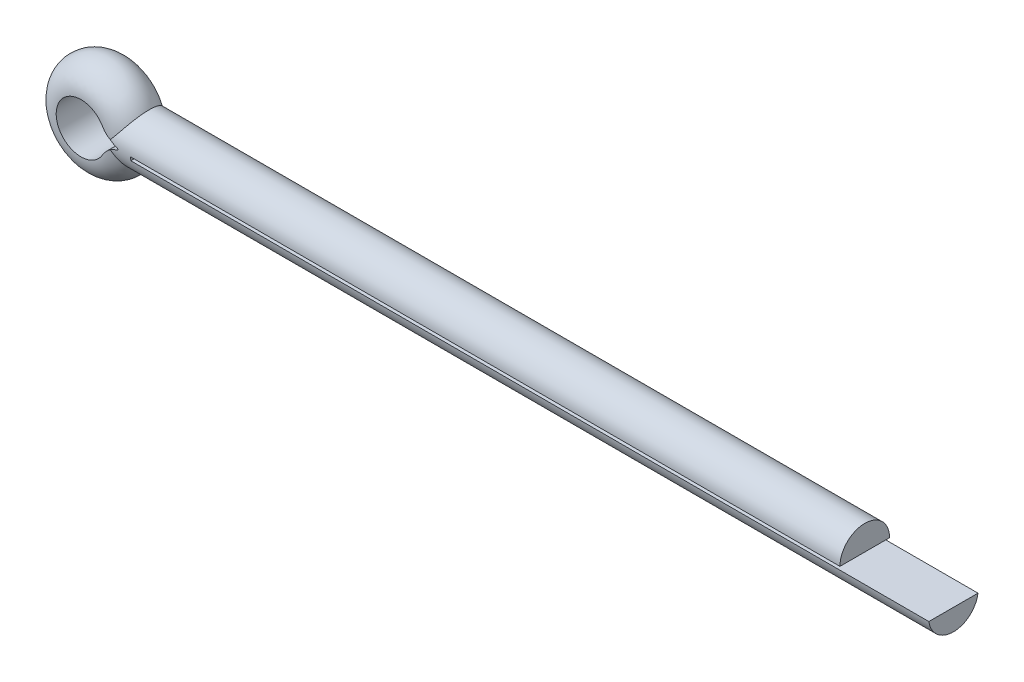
ISO-10303-21;
HEADER;
FILE_DESCRIPTION(('STEP AP214'),'2;1');
FILE_NAME('part.step','',(''),(''),'','','');
FILE_SCHEMA(('AUTOMOTIVE_DESIGN { 1 0 10303 214 1 1 1 1 }'));
ENDSEC;
DATA;
#1=APPLICATION_CONTEXT('core data for automotive mechanical design processes');
#2=APPLICATION_PROTOCOL_DEFINITION('international standard','automotive_design',2000,#1);
#3=PRODUCT_CONTEXT('',#1,'mechanical');
#4=PRODUCT('Part','Part','',(#3));
#5=PRODUCT_RELATED_PRODUCT_CATEGORY('part','',(#4));
#6=PRODUCT_DEFINITION_FORMATION('','',#4);
#7=PRODUCT_DEFINITION_CONTEXT('part definition',#1,'design');
#8=PRODUCT_DEFINITION('design','',#6,#7);
#9=PRODUCT_DEFINITION_SHAPE('','',#8);
#10=(LENGTH_UNIT() NAMED_UNIT(*) SI_UNIT(.MILLI.,.METRE.));
#11=(NAMED_UNIT(*) PLANE_ANGLE_UNIT() SI_UNIT($,.RADIAN.));
#12=(NAMED_UNIT(*) SI_UNIT($,.STERADIAN.) SOLID_ANGLE_UNIT());
#13=UNCERTAINTY_MEASURE_WITH_UNIT(LENGTH_MEASURE(1.E-05),#10,'distance_accuracy_value','');
#14=(GEOMETRIC_REPRESENTATION_CONTEXT(3) GLOBAL_UNCERTAINTY_ASSIGNED_CONTEXT((#13)) GLOBAL_UNIT_ASSIGNED_CONTEXT((#10,
#11,#12)) REPRESENTATION_CONTEXT('',''));
#15=CARTESIAN_POINT('',(0.,0.,0.));
#16=DIRECTION('',(0.,0.,1.));
#17=DIRECTION('',(1.,0.,0.));
#18=AXIS2_PLACEMENT_3D('',#15,#16,#17);
#19=CARTESIAN_POINT('',(-0.387524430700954,0.,1.40000000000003));
#20=DIRECTION('',(0.,0.,-1.));
#21=DIRECTION('',(-1.,0.,0.));
#22=AXIS2_PLACEMENT_3D('',#19,#20,#21);
#23=CYLINDRICAL_SURFACE('',#22,0.0280000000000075);
#24=DIRECTION('',(0.,0.,-1.));
#25=VECTOR('',#24,1.);
#26=CARTESIAN_POINT('',(-0.379833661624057,0.026923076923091,1.40000000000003));
#27=LINE('',#26,#25);
#28=CARTESIAN_POINT('',(-0.379833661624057,0.0269230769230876,0.699482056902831));
#29=VERTEX_POINT('',#28);
#30=CARTESIAN_POINT('',(-0.379833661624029,0.0269230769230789,-0.699482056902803));
#31=VERTEX_POINT('',#30);
#32=EDGE_CURVE('E115',#29,#31,#27,.T.);
#33=ORIENTED_EDGE('',*,*,#32,.T.);
#34=CARTESIAN_POINT('',(-0.379833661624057,-0.0269230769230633,-0.699482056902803));
#35=CARTESIAN_POINT('',(-0.378318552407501,-0.0264916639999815,-0.699498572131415));
#36=CARTESIAN_POINT('',(-0.376841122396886,-0.0259300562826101,-0.699519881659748));
#37=CARTESIAN_POINT('',(-0.374002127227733,-0.0245683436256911,-0.699569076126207));
#38=CARTESIAN_POINT('',(-0.372640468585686,-0.0237684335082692,-0.699596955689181));
#39=CARTESIAN_POINT('',(-0.370070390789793,-0.021950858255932,-0.699656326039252));
#40=CARTESIAN_POINT('',(-0.368862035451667,-0.0209331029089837,-0.6996878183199));
#41=CARTESIAN_POINT('',(-0.366633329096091,-0.0187093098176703,-0.699750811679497));
#42=CARTESIAN_POINT('',(-0.365612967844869,-0.0175032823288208,-0.699782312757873));
#43=CARTESIAN_POINT('',(-0.363788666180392,-0.0149363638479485,-0.699841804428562));
#44=CARTESIAN_POINT('',(-0.362984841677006,-0.0135753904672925,-0.699869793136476));
#45=CARTESIAN_POINT('',(-0.361617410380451,-0.0107379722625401,-0.699919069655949));
#46=CARTESIAN_POINT('',(-0.361053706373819,-0.00926157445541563,-0.699940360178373));
#47=CARTESIAN_POINT('',(-0.360255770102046,-0.0064911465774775,-0.699971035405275));
#48=CARTESIAN_POINT('',(-0.359982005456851,-0.00520835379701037,-0.699981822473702));
#49=CARTESIAN_POINT('',(-0.359616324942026,-0.00261715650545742,-0.699996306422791));
#50=CARTESIAN_POINT('',(-0.359524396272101,-0.00130875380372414,-0.700000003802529));
#51=CARTESIAN_POINT('',(-0.359524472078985,0.00157291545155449,-0.699999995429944));
#52=CARTESIAN_POINT('',(-0.359657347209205,0.00314633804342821,-0.69999464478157));
#53=CARTESIAN_POINT('',(-0.360185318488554,0.0062491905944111,-0.699973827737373));
#54=CARTESIAN_POINT('',(-0.360580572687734,0.00777859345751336,-0.699958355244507));
#55=CARTESIAN_POINT('',(-0.36162200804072,0.010748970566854,-0.699919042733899));
#56=CARTESIAN_POINT('',(-0.362268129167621,0.0121899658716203,-0.699895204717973));
#57=CARTESIAN_POINT('',(-0.363792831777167,0.0149427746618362,-0.699841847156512));
#58=CARTESIAN_POINT('',(-0.364671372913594,0.0162546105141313,-0.699812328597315));
#59=CARTESIAN_POINT('',(-0.366636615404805,0.0187130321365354,-0.699750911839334));
#60=CARTESIAN_POINT('',(-0.367723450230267,0.0198595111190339,-0.699719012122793));
#61=CARTESIAN_POINT('',(-0.370074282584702,0.0219538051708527,-0.699656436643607));
#62=CARTESIAN_POINT('',(-0.371338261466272,0.0229016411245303,-0.699625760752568));
#63=CARTESIAN_POINT('',(-0.373783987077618,0.0244319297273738,-0.699573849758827));
#64=CARTESIAN_POINT('',(-0.374944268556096,0.0250489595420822,-0.699551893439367));
#65=CARTESIAN_POINT('',(-0.377338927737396,0.0261147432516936,-0.699512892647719));
#66=CARTESIAN_POINT('',(-0.378573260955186,0.0265635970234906,-0.699495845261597));
#67=CARTESIAN_POINT('',(-0.379833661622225,0.026923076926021,-0.699482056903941));
#68=B_SPLINE_CURVE_WITH_KNOTS('',3,(#34,#35,#36,#37,#38,#39,#40,#41,#42,#43,#44,#45,#46,#47,#48,
#49,#50,#51,#52,#53,#54,#55,#56,#57,#58,#59,#60,#61,#62,#63,#64,#65,#66,#67),.UNSPECIFIED.,.F.,
.F.,(4,2,2,2,2,2,2,2,2,2,2,2,2,2,2,2,4),(0.,0.00471994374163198,0.00943603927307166,
0.0141540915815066,0.0188718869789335,0.0235922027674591,0.0283106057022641,0.0322332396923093,
0.0361555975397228,0.0408696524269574,0.0455865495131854,0.0503023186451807,0.0550172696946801,
0.0597352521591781,0.0644527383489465,0.0683831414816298,0.0723112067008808),.UNSPECIFIED.);
#69=CARTESIAN_POINT('',(-0.379833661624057,-0.0269230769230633,-0.699482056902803));
#70=VERTEX_POINT('',#69);
#71=EDGE_CURVE('E23',#70,#31,#68,.T.);
#72=ORIENTED_EDGE('',*,*,#71,.F.);
#73=DIRECTION('',(0.,0.,-1.));
#74=VECTOR('',#73,1.);
#75=CARTESIAN_POINT('',(-0.37983366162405,-0.0269230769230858,1.40000000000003));
#76=LINE('',#75,#74);
#77=CARTESIAN_POINT('',(-0.37983366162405,-0.0269230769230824,0.699482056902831));
#78=VERTEX_POINT('',#77);
#79=EDGE_CURVE('E206',#70,#78,#76,.F.);
#80=ORIENTED_EDGE('',*,*,#79,.T.);
#81=CARTESIAN_POINT('',(-0.379833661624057,0.0269230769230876,0.699482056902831));
#82=CARTESIAN_POINT('',(-0.378318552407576,0.0264916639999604,0.699498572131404));
#83=CARTESIAN_POINT('',(-0.376841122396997,0.0259300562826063,0.699519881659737));
#84=CARTESIAN_POINT('',(-0.374002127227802,0.0245683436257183,0.699569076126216));
#85=CARTESIAN_POINT('',(-0.372640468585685,0.0237684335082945,0.69959695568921));
#86=CARTESIAN_POINT('',(-0.370070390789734,0.0219508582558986,0.699656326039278));
#87=CARTESIAN_POINT('',(-0.368862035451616,0.0209331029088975,0.699687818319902));
#88=CARTESIAN_POINT('',(-0.366633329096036,0.0187093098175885,0.6997508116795));
#89=CARTESIAN_POINT('',(-0.365612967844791,0.0175032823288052,0.699782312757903));
#90=CARTESIAN_POINT('',(-0.363788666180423,0.0149363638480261,0.699841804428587));
#91=CARTESIAN_POINT('',(-0.362984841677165,0.0135753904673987,0.69986979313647));
#92=CARTESIAN_POINT('',(-0.361617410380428,0.0107379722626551,0.699919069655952));
#93=CARTESIAN_POINT('',(-0.361053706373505,0.00926157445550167,0.699940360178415));
#94=CARTESIAN_POINT('',(-0.360255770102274,0.00649114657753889,0.699971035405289));
#95=CARTESIAN_POINT('',(-0.359982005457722,0.00520835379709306,0.699981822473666));
#96=CARTESIAN_POINT('',(-0.359616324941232,0.00261715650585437,0.699996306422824));
#97=CARTESIAN_POINT('',(-0.359524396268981,0.00130875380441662,0.700000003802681));
#98=CARTESIAN_POINT('',(-0.359524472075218,-0.00157291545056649,0.699999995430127));
#99=CARTESIAN_POINT('',(-0.359657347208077,-0.00314633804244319,0.699994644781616));
#100=CARTESIAN_POINT('',(-0.360185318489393,-0.00624919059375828,0.699973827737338));
#101=CARTESIAN_POINT('',(-0.36058057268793,-0.0077785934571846,0.699958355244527));
#102=CARTESIAN_POINT('',(-0.361622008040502,-0.0107489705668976,0.699919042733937));
#103=CARTESIAN_POINT('',(-0.362268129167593,-0.0121899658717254,0.699895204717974));
#104=CARTESIAN_POINT('',(-0.363792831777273,-0.0149427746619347,0.699841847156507));
#105=CARTESIAN_POINT('',(-0.364671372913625,-0.0162546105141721,0.699812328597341));
#106=CARTESIAN_POINT('',(-0.36663661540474,-0.0187130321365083,0.699750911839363));
#107=CARTESIAN_POINT('',(-0.367723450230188,-0.0198595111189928,0.699719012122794));
#108=CARTESIAN_POINT('',(-0.370074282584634,-0.0219538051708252,0.699656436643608));
#109=CARTESIAN_POINT('',(-0.371338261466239,-0.0229016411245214,0.699625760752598));
#110=CARTESIAN_POINT('',(-0.37378398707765,-0.0244319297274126,0.699573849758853));
#111=CARTESIAN_POINT('',(-0.374944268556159,-0.0250489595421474,0.699551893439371));
#112=CARTESIAN_POINT('',(-0.377338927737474,-0.026114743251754,0.69951289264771));
#113=CARTESIAN_POINT('',(-0.378573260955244,-0.0265635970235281,0.699495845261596));
#114=CARTESIAN_POINT('',(-0.379833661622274,-0.0269230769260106,0.699482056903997));
#115=B_SPLINE_CURVE_WITH_KNOTS('',3,(#81,#82,#83,#84,#85,#86,#87,#88,#89,#90,#91,#92,#93,#94,
#95,#96,#97,#98,#99,#100,#101,#102,#103,#104,#105,#106,#107,#108,#109,#110,#111,#112,#113,#114),
.UNSPECIFIED.,.F.,.F.,(4,2,2,2,2,2,2,2,2,2,2,2,2,2,2,2,4),(0.,0.00471994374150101,
0.00943603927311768,0.0141540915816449,0.0188718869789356,0.0235922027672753,0.0283106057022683,
0.0322332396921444,0.0361555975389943,0.0408696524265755,0.0455865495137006,0.0503023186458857,
0.0550172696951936,0.0597352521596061,0.0644527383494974,0.0683831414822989,0.0723112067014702),.UNSPECIFIED.);
#116=EDGE_CURVE('E116',#29,#78,#115,.T.);
#117=ORIENTED_EDGE('',*,*,#116,.F.);
#118=EDGE_LOOP('',(#33,#72,#80,#117));
#119=FACE_BOUND('',#118,.T.);
#120=ADVANCED_FACE('F19',(#119),#23,.F.);
#121=CARTESIAN_POINT('',(20.,1.40000000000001,1.39999999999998));
#122=DIRECTION('',(-1.,0.,0.));
#123=DIRECTION('',(0.,0.,1.));
#124=AXIS2_PLACEMENT_3D('',#121,#122,#123);
#125=PLANE('',#124);
#126=DIRECTION('',(0.,0.,-1.));
#127=VECTOR('',#126,1.);
#128=CARTESIAN_POINT('',(20.0000000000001,0.,-0.700000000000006));
#129=LINE('',#128,#127);
#130=CARTESIAN_POINT('',(20.0000000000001,0.,-0.700000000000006));
#131=VERTEX_POINT('',#130);
#132=CARTESIAN_POINT('',(20.0000000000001,0.,0.699999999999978));
#133=VERTEX_POINT('',#132);
#134=EDGE_CURVE('E107',#131,#133,#129,.F.);
#135=ORIENTED_EDGE('',*,*,#134,.F.);
#136=CARTESIAN_POINT('',(20.0000000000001,0.,0.));
#137=DIRECTION('',(1.,0.,0.));
#138=DIRECTION('',(0.,0.,-1.));
#139=AXIS2_PLACEMENT_3D('',#136,#137,#138);
#140=CIRCLE('',#139,0.7);
#141=EDGE_CURVE('E111',#133,#131,#140,.F.);
#142=ORIENTED_EDGE('',*,*,#141,.F.);
#143=EDGE_LOOP('',(#135,#142));
#144=FACE_BOUND('',#143,.T.);
#145=ADVANCED_FACE('F109',(#144),#125,.F.);
#146=CARTESIAN_POINT('',(0.,0.,-0.700000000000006));
#147=DIRECTION('',(0.,-1.,0.));
#148=DIRECTION('',(0.,0.,-1.));
#149=AXIS2_PLACEMENT_3D('',#146,#147,#148);
#150=PLANE('',#149);
#151=DIRECTION('',(0.,0.,-1.));
#152=VECTOR('',#151,1.);
#153=CARTESIAN_POINT('',(0.,0.,0.));
#154=LINE('',#153,#152);
#155=CARTESIAN_POINT('',(0.,0.,-0.700000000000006));
#156=VERTEX_POINT('',#155);
#157=CARTESIAN_POINT('',(0.,0.,0.700000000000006));
#158=VERTEX_POINT('',#157);
#159=EDGE_CURVE('E121',#156,#158,#154,.F.);
#160=ORIENTED_EDGE('',*,*,#159,.F.);
#161=DIRECTION('',(1.,0.,0.));
#162=VECTOR('',#161,1.);
#163=CARTESIAN_POINT('',(0.,0.,-0.700000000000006));
#164=LINE('',#163,#162);
#165=EDGE_CURVE('E119',#131,#156,#164,.F.);
#166=ORIENTED_EDGE('',*,*,#165,.F.);
#167=ORIENTED_EDGE('',*,*,#134,.T.);
#168=DIRECTION('',(1.,0.,0.));
#169=VECTOR('',#168,1.);
#170=CARTESIAN_POINT('',(0.,0.,0.700000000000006));
#171=LINE('',#170,#169);
#172=EDGE_CURVE('E127',#158,#133,#171,.T.);
#173=ORIENTED_EDGE('',*,*,#172,.F.);
#174=EDGE_LOOP('',(#160,#166,#167,#173));
#175=FACE_BOUND('',#174,.T.);
#176=ADVANCED_FACE('F120',(#175),#150,.T.);
#177=CARTESIAN_POINT('',(-0.187564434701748,0.700000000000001,0.708400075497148));
#178=DIRECTION('',(0.,0.,-1.));
#179=DIRECTION('',(-1.,0.,0.));
#180=AXIS2_PLACEMENT_3D('',#177,#178,#179);
#181=CYLINDRICAL_SURFACE('',#180,0.700000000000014);
#182=CARTESIAN_POINT('',(-0.793782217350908,0.350000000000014,0.70000000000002));
#183=CARTESIAN_POINT('',(-0.783921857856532,0.332916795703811,0.699977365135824));
#184=CARTESIAN_POINT('',(-0.77333532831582,0.316252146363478,0.699999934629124));
#185=CARTESIAN_POINT('',(-0.750781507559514,0.283856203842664,0.699964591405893));
#186=CARTESIAN_POINT('',(-0.738812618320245,0.268126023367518,0.699906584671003));
#187=CARTESIAN_POINT('',(-0.713845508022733,0.238044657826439,0.699542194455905));
#188=CARTESIAN_POINT('',(-0.700873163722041,0.223671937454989,0.699240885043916));
#189=CARTESIAN_POINT('',(-0.67380261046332,0.196069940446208,0.698124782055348));
#190=CARTESIAN_POINT('',(-0.659705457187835,0.182839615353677,0.697310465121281));
#191=CARTESIAN_POINT('',(-0.635580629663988,0.162003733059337,0.695299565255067));
#192=CARTESIAN_POINT('',(-0.625840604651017,0.154040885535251,0.694334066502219));
#193=CARTESIAN_POINT('',(-0.605912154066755,0.138621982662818,0.691973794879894));
#194=CARTESIAN_POINT('',(-0.595721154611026,0.131169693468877,0.690576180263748));
#195=CARTESIAN_POINT('',(-0.585359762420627,0.124014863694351,0.688924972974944));
#196=B_SPLINE_CURVE_WITH_KNOTS('',3,(#182,#183,#184,#185,#186,#187,#188,#189,#190,#191,#192,
#193,#194,#195),.UNSPECIFIED.,.F.,.F.,(4,2,2,2,2,2,4),(0.,0.0591576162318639,0.118384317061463,
0.176406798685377,0.23437545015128,0.272205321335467,0.310289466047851),.UNSPECIFIED.);
#197=CARTESIAN_POINT('',(-0.793782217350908,0.350000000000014,0.70000000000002));
#198=VERTEX_POINT('',#197);
#199=CARTESIAN_POINT('',(-0.585360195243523,0.124013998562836,0.688926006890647));
#200=VERTEX_POINT('',#199);
#201=EDGE_CURVE('E236',#198,#200,#196,.T.);
#202=ORIENTED_EDGE('',*,*,#201,.F.);
#203=DIRECTION('',(0.,0.,-1.));
#204=VECTOR('',#203,1.);
#205=CARTESIAN_POINT('',(-0.793782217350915,0.350000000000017,1.40000000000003));
#206=LINE('',#205,#204);
#207=CARTESIAN_POINT('',(-0.793782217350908,0.35000000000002,-0.699999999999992));
#208=VERTEX_POINT('',#207);
#209=EDGE_CURVE('E124',#198,#208,#206,.T.);
#210=ORIENTED_EDGE('',*,*,#209,.T.);
#211=CARTESIAN_POINT('',(-0.585359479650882,0.12401466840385,-0.688924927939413));
#212=CARTESIAN_POINT('',(-0.601189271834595,0.134940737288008,-0.691449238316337));
#213=CARTESIAN_POINT('',(-0.616614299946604,0.146563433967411,-0.693378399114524));
#214=CARTESIAN_POINT('',(-0.646495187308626,0.171082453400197,-0.696338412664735));
#215=CARTESIAN_POINT('',(-0.660951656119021,0.183977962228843,-0.697369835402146));
#216=CARTESIAN_POINT('',(-0.688500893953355,0.210689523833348,-0.6988154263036));
#217=CARTESIAN_POINT('',(-0.701613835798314,0.224484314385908,-0.699240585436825));
#218=CARTESIAN_POINT('',(-0.726672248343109,0.253095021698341,-0.699775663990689));
#219=CARTESIAN_POINT('',(-0.738618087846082,0.267910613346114,-0.699885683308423));
#220=CARTESIAN_POINT('',(-0.757849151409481,0.293857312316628,-0.699980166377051));
#221=CARTESIAN_POINT('',(-0.765453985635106,0.304753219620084,-0.699992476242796));
#222=CARTESIAN_POINT('',(-0.78007993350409,0.327033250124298,-0.70000003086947));
#223=CARTESIAN_POINT('',(-0.787096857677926,0.3384201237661,-0.699995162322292));
#224=CARTESIAN_POINT('',(-0.793782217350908,0.35000000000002,-0.699999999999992));
#225=B_SPLINE_CURVE_WITH_KNOTS('',3,(#211,#212,#213,#214,#215,#216,#217,#218,#219,#220,#221,
#222,#223,#224),.UNSPECIFIED.,.F.,.F.,(4,2,2,2,2,2,4),(0.,0.0581510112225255,0.116265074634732,
0.173311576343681,0.23033999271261,0.270181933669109,0.310287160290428),.UNSPECIFIED.);
#226=CARTESIAN_POINT('',(-0.585359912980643,0.124013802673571,-0.688925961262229));
#227=VERTEX_POINT('',#226);
#228=EDGE_CURVE('E238',#227,#208,#225,.T.);
#229=ORIENTED_EDGE('',*,*,#228,.F.);
#230=CARTESIAN_POINT('',(-0.379833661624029,0.0269230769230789,-0.699482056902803));
#231=CARTESIAN_POINT('',(-0.398217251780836,0.0321723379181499,-0.699275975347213));
#232=CARTESIAN_POINT('',(-0.416385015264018,0.0381788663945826,-0.698989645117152));
#233=CARTESIAN_POINT('',(-0.452035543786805,0.0516061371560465,-0.698128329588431));
#234=CARTESIAN_POINT('',(-0.469522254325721,0.0590165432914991,-0.69755540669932));
#235=CARTESIAN_POINT('',(-0.503822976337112,0.0752278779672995,-0.695993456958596));
#236=CARTESIAN_POINT('',(-0.520636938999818,0.084028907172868,-0.695004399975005));
#237=CARTESIAN_POINT('',(-0.553581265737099,0.103010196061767,-0.692445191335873));
#238=CARTESIAN_POINT('',(-0.569705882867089,0.113199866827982,-0.690870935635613));
#239=CARTESIAN_POINT('',(-0.585359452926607,0.124014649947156,-0.688926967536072));
#240=B_SPLINE_CURVE_WITH_KNOTS('',3,(#230,#231,#232,#233,#234,#235,#236,#237,#238,#239),
.UNSPECIFIED.,.F.,.F.,(4,2,2,2,4),(0.,0.0573440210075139,0.11428118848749,0.171222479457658,
0.228570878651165),.UNSPECIFIED.);
#241=EDGE_CURVE('E140',#31,#227,#240,.T.);
#242=ORIENTED_EDGE('',*,*,#241,.F.);
#243=ORIENTED_EDGE('',*,*,#32,.F.);
#244=CARTESIAN_POINT('',(-0.585359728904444,0.124014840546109,0.688926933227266));
#245=CARTESIAN_POINT('',(-0.56970614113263,0.113200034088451,0.69087090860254));
#246=CARTESIAN_POINT('',(-0.553581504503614,0.103010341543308,0.692445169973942));
#247=CARTESIAN_POINT('',(-0.520637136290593,0.0840290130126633,0.695004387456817));
#248=CARTESIAN_POINT('',(-0.503823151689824,0.0752279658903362,0.695993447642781));
#249=CARTESIAN_POINT('',(-0.469522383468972,0.0590165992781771,0.697555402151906));
#250=CARTESIAN_POINT('',(-0.4520356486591,0.051606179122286,0.698128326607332));
#251=CARTESIAN_POINT('',(-0.41638506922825,0.0381788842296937,0.698989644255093));
#252=CARTESIAN_POINT('',(-0.398217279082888,0.0321723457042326,0.699275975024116));
#253=CARTESIAN_POINT('',(-0.379833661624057,0.0269230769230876,0.699482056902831));
#254=B_SPLINE_CURVE_WITH_KNOTS('',3,(#244,#245,#246,#247,#248,#249,#250,#251,#252,#253),
.UNSPECIFIED.,.F.,.F.,(4,2,2,2,4),(0.,0.0573484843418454,0.114289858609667,0.171227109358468,
0.228571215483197),.UNSPECIFIED.);
#255=EDGE_CURVE('E129',#200,#29,#254,.T.);
#256=ORIENTED_EDGE('',*,*,#255,.F.);
#257=EDGE_LOOP('',(#202,#210,#229,#242,#243,#256));
#258=FACE_BOUND('',#257,.T.);
#259=ADVANCED_FACE('F149',(#258),#181,.T.);
#260=CARTESIAN_POINT('',(-0.187564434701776,-0.700000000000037,0.708399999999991));
#261=DIRECTION('',(0.,0.,-1.));
#262=DIRECTION('',(-1.,0.,0.));
#263=AXIS2_PLACEMENT_3D('',#260,#261,#262);
#264=CYLINDRICAL_SURFACE('',#263,0.700000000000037);
#265=ORIENTED_EDGE('',*,*,#79,.F.);
#266=CARTESIAN_POINT('',(-0.585359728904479,-0.124014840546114,-0.68892693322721));
#267=CARTESIAN_POINT('',(-0.569706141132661,-0.11320003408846,-0.69087090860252));
#268=CARTESIAN_POINT('',(-0.553581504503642,-0.103010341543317,-0.692445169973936));
#269=CARTESIAN_POINT('',(-0.520637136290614,-0.0840290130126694,-0.695004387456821));
#270=CARTESIAN_POINT('',(-0.503823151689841,-0.0752279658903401,-0.695993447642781));
#271=CARTESIAN_POINT('',(-0.469522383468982,-0.0590165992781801,-0.697555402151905));
#272=CARTESIAN_POINT('',(-0.452035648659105,-0.0516061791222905,-0.698128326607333));
#273=CARTESIAN_POINT('',(-0.416385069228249,-0.0381788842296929,-0.698989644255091));
#274=CARTESIAN_POINT('',(-0.398217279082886,-0.032172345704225,-0.699275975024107));
#275=CARTESIAN_POINT('',(-0.379833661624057,-0.0269230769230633,-0.699482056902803));
#276=B_SPLINE_CURVE_WITH_KNOTS('',3,(#266,#267,#268,#269,#270,#271,#272,#273,#274,#275),
.UNSPECIFIED.,.F.,.F.,(4,2,2,2,4),(0.,0.0573484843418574,0.114289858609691,0.171227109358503,
0.228571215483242),.UNSPECIFIED.);
#277=CARTESIAN_POINT('',(-0.585360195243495,-0.124013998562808,-0.688926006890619));
#278=VERTEX_POINT('',#277);
#279=EDGE_CURVE('E211',#278,#70,#276,.T.);
#280=ORIENTED_EDGE('',*,*,#279,.F.);
#281=CARTESIAN_POINT('',(-0.793782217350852,-0.350000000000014,-0.699999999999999));
#282=CARTESIAN_POINT('',(-0.783921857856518,-0.332916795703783,-0.699977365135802));
#283=CARTESIAN_POINT('',(-0.773335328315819,-0.316252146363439,-0.699999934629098));
#284=CARTESIAN_POINT('',(-0.750781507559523,-0.283856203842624,-0.699964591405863));
#285=CARTESIAN_POINT('',(-0.73881261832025,-0.268126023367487,-0.699906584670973));
#286=CARTESIAN_POINT('',(-0.713845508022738,-0.238044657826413,-0.69954219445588));
#287=CARTESIAN_POINT('',(-0.70087316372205,-0.223671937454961,-0.699240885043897));
#288=CARTESIAN_POINT('',(-0.67380261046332,-0.196069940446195,-0.698124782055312));
#289=CARTESIAN_POINT('',(-0.65970545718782,-0.182839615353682,-0.697310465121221));
#290=CARTESIAN_POINT('',(-0.635580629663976,-0.162003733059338,-0.695299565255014));
#291=CARTESIAN_POINT('',(-0.625840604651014,-0.154040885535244,-0.694334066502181));
#292=CARTESIAN_POINT('',(-0.605912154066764,-0.1386219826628,-0.691973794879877));
#293=CARTESIAN_POINT('',(-0.595721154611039,-0.131169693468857,-0.690576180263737));
#294=CARTESIAN_POINT('',(-0.585359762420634,-0.124014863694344,-0.688924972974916));
#295=B_SPLINE_CURVE_WITH_KNOTS('',3,(#281,#282,#283,#284,#285,#286,#287,#288,#289,#290,#291,
#292,#293,#294),.UNSPECIFIED.,.F.,.F.,(4,2,2,2,2,2,4),(0.,0.0591576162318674,0.118384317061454,
0.176406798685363,0.234375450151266,0.272205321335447,0.310289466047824),.UNSPECIFIED.);
#296=CARTESIAN_POINT('',(-0.793782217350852,-0.350000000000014,-0.699999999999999));
#297=VERTEX_POINT('',#296);
#298=EDGE_CURVE('E93',#297,#278,#295,.T.);
#299=ORIENTED_EDGE('',*,*,#298,.F.);
#300=DIRECTION('',(0.,0.,-1.));
#301=VECTOR('',#300,1.);
#302=CARTESIAN_POINT('',(-0.793782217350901,-0.349999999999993,1.39999999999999));
#303=LINE('',#302,#301);
#304=CARTESIAN_POINT('',(-0.793782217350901,-0.349999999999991,0.700000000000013));
#305=VERTEX_POINT('',#304);
#306=EDGE_CURVE('E262',#297,#305,#303,.F.);
#307=ORIENTED_EDGE('',*,*,#306,.T.);
#308=CARTESIAN_POINT('',(-0.585359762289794,-0.124014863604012,0.688924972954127));
#309=CARTESIAN_POINT('',(-0.601189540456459,-0.134940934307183,0.691449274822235));
#310=CARTESIAN_POINT('',(-0.616614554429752,-0.146563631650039,0.693378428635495));
#311=CARTESIAN_POINT('',(-0.646495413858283,-0.171082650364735,0.696338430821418));
#312=CARTESIAN_POINT('',(-0.660951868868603,-0.18397815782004,0.697369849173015));
#313=CARTESIAN_POINT('',(-0.688501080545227,-0.210689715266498,0.698815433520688));
#314=CARTESIAN_POINT('',(-0.701614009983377,-0.224484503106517,0.699240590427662));
#315=CARTESIAN_POINT('',(-0.726672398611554,-0.253095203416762,0.699775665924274));
#316=CARTESIAN_POINT('',(-0.738618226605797,-0.267910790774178,0.699885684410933));
#317=CARTESIAN_POINT('',(-0.757849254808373,-0.293857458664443,0.699980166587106));
#318=CARTESIAN_POINT('',(-0.765454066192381,-0.304753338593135,0.69999247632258));
#319=CARTESIAN_POINT('',(-0.78007997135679,-0.327033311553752,0.700000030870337));
#320=CARTESIAN_POINT('',(-0.787096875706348,-0.338420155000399,0.699995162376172));
#321=CARTESIAN_POINT('',(-0.793782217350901,-0.349999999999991,0.700000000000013));
#322=B_SPLINE_CURVE_WITH_KNOTS('',3,(#308,#309,#310,#311,#312,#313,#314,#315,#316,#317,#318,
#319,#320,#321),.UNSPECIFIED.,.F.,.F.,(4,2,2,2,2,2,4),(0.,0.0581509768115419,0.116265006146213,
0.173311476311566,0.230339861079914,0.270181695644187,0.310286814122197),.UNSPECIFIED.);
#323=CARTESIAN_POINT('',(-0.58536019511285,-0.12401399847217,0.688926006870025));
#324=VERTEX_POINT('',#323);
#325=EDGE_CURVE('E235',#324,#305,#322,.T.);
#326=ORIENTED_EDGE('',*,*,#325,.F.);
#327=CARTESIAN_POINT('',(-0.37983366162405,-0.0269230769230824,0.699482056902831));
#328=CARTESIAN_POINT('',(-0.398217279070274,-0.0321723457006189,0.699275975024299));
#329=CARTESIAN_POINT('',(-0.416385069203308,-0.038178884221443,0.698989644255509));
#330=CARTESIAN_POINT('',(-0.452035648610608,-0.0516061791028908,0.698128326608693));
#331=CARTESIAN_POINT('',(-0.469522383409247,-0.0590165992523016,0.697555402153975));
#332=CARTESIAN_POINT('',(-0.503823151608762,-0.0752279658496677,0.695993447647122));
#333=CARTESIAN_POINT('',(-0.520637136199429,-0.0840290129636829,0.695004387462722));
#334=CARTESIAN_POINT('',(-0.553581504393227,-0.103010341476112,0.692445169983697));
#335=CARTESIAN_POINT('',(-0.569706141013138,-0.113200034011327,0.690870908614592));
#336=CARTESIAN_POINT('',(-0.585359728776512,-0.124014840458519,0.688926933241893));
#337=B_SPLINE_CURVE_WITH_KNOTS('',3,(#327,#328,#329,#330,#331,#332,#333,#334,#335,#336),
.UNSPECIFIED.,.F.,.F.,(4,2,2,2,4),(0.,0.0573441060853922,0.114281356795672,0.171222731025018,
0.228571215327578),.UNSPECIFIED.);
#338=EDGE_CURVE('E204',#78,#324,#337,.T.);
#339=ORIENTED_EDGE('',*,*,#338,.F.);
#340=EDGE_LOOP('',(#265,#280,#299,#307,#326,#339));
#341=FACE_BOUND('',#340,.T.);
#342=ADVANCED_FACE('F213',(#341),#264,.T.);
#343=CARTESIAN_POINT('',(0.,0.,0.));
#344=DIRECTION('',(1.,0.,0.));
#345=DIRECTION('',(0.,0.,-1.));
#346=AXIS2_PLACEMENT_3D('',#343,#344,#345);
#347=PLANE('',#346);
#348=ORIENTED_EDGE('',*,*,#159,.T.);
#349=CARTESIAN_POINT('',(0.,0.,0.));
#350=DIRECTION('',(1.,0.,0.));
#351=DIRECTION('',(0.,0.,-1.));
#352=AXIS2_PLACEMENT_3D('',#349,#350,#351);
#353=CIRCLE('',#352,0.7);
#354=CARTESIAN_POINT('',(0.,-0.100000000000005,0.69282032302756));
#355=VERTEX_POINT('',#354);
#356=EDGE_CURVE('E43',#158,#355,#353,.T.);
#357=ORIENTED_EDGE('',*,*,#356,.T.);
#358=DIRECTION('',(0.,0.,1.));
#359=VECTOR('',#358,1.);
#360=CARTESIAN_POINT('',(0.,-0.100000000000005,0.69282032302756));
#361=LINE('',#360,#359);
#362=CARTESIAN_POINT('',(0.,-0.0999999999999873,-0.69282032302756));
#363=VERTEX_POINT('',#362);
#364=EDGE_CURVE('E270',#363,#355,#361,.T.);
#365=ORIENTED_EDGE('',*,*,#364,.F.);
#366=CARTESIAN_POINT('',(0.,0.,0.));
#367=DIRECTION('',(1.,0.,0.));
#368=DIRECTION('',(0.,0.,-1.));
#369=AXIS2_PLACEMENT_3D('',#366,#367,#368);
#370=CIRCLE('',#369,0.7);
#371=EDGE_CURVE('E201',#363,#156,#370,.T.);
#372=ORIENTED_EDGE('',*,*,#371,.T.);
#373=EDGE_LOOP('',(#348,#357,#365,#372));
#374=FACE_BOUND('',#373,.T.);
#375=ADVANCED_FACE('F217',(#374),#347,.T.);
#376=CARTESIAN_POINT('',(-1.40000000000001,0.,1.40000000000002));
#377=DIRECTION('',(0.,0.,-1.));
#378=DIRECTION('',(-1.,0.,0.));
#379=AXIS2_PLACEMENT_3D('',#376,#377,#378);
#380=CYLINDRICAL_SURFACE('',#379,0.700000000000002);
#381=ORIENTED_EDGE('',*,*,#306,.F.);
#382=CARTESIAN_POINT('',(-1.40000000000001,0.,-0.699999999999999));
#383=DIRECTION('',(0.,0.,-1.));
#384=DIRECTION('',(-1.,0.,0.));
#385=AXIS2_PLACEMENT_3D('',#382,#383,#384);
#386=CIRCLE('',#385,0.700000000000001);
#387=EDGE_CURVE('E272',#208,#297,#386,.F.);
#388=ORIENTED_EDGE('',*,*,#387,.F.);
#389=ORIENTED_EDGE('',*,*,#209,.F.);
#390=CARTESIAN_POINT('',(-1.40000000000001,0.,0.700000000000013));
#391=DIRECTION('',(0.,0.,-1.));
#392=DIRECTION('',(-1.,0.,0.));
#393=AXIS2_PLACEMENT_3D('',#390,#391,#392);
#394=CIRCLE('',#393,0.700000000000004);
#395=EDGE_CURVE('E260',#305,#198,#394,.T.);
#396=ORIENTED_EDGE('',*,*,#395,.F.);
#397=EDGE_LOOP('',(#381,#388,#389,#396));
#398=FACE_BOUND('',#397,.T.);
#399=ADVANCED_FACE('F268',(#398),#380,.F.);
#400=CARTESIAN_POINT('',(22.5,0.,1.39999999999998));
#401=DIRECTION('',(-1.,0.,0.));
#402=DIRECTION('',(0.,0.,1.));
#403=AXIS2_PLACEMENT_3D('',#400,#401,#402);
#404=PLANE('',#403);
#405=CARTESIAN_POINT('',(22.5,0.,0.));
#406=DIRECTION('',(1.,0.,0.));
#407=DIRECTION('',(0.,0.,-1.));
#408=AXIS2_PLACEMENT_3D('',#405,#406,#407);
#409=CIRCLE('',#408,0.7);
#410=CARTESIAN_POINT('',(22.5000000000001,-0.100000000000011,-0.69282032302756));
#411=VERTEX_POINT('',#410);
#412=CARTESIAN_POINT('',(22.5000000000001,-0.100000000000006,0.692820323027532));
#413=VERTEX_POINT('',#412);
#414=EDGE_CURVE('E192',#411,#413,#409,.F.);
#415=ORIENTED_EDGE('',*,*,#414,.F.);
#416=DIRECTION('',(0.,0.,1.));
#417=VECTOR('',#416,1.);
#418=CARTESIAN_POINT('',(22.5000000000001,-0.100000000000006,0.692820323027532));
#419=LINE('',#418,#417);
#420=EDGE_CURVE('E265',#413,#411,#419,.F.);
#421=ORIENTED_EDGE('',*,*,#420,.F.);
#422=EDGE_LOOP('',(#415,#421));
#423=FACE_BOUND('',#422,.T.);
#424=ADVANCED_FACE('F318',(#423),#404,.F.);
#425=CARTESIAN_POINT('',(0.,-0.100000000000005,0.69282032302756));
#426=DIRECTION('',(0.,1.,0.));
#427=DIRECTION('',(0.,0.,1.));
#428=AXIS2_PLACEMENT_3D('',#425,#426,#427);
#429=PLANE('',#428);
#430=ORIENTED_EDGE('',*,*,#364,.T.);
#431=DIRECTION('',(1.,0.,0.));
#432=VECTOR('',#431,1.);
#433=CARTESIAN_POINT('',(0.,-0.100000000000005,0.69282032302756));
#434=LINE('',#433,#432);
#435=EDGE_CURVE('E34',#413,#355,#434,.F.);
#436=ORIENTED_EDGE('',*,*,#435,.F.);
#437=ORIENTED_EDGE('',*,*,#420,.T.);
#438=DIRECTION('',(1.,0.,0.));
#439=VECTOR('',#438,1.);
#440=CARTESIAN_POINT('',(0.,-0.0999999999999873,-0.69282032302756));
#441=LINE('',#440,#439);
#442=EDGE_CURVE('E275',#363,#411,#441,.T.);
#443=ORIENTED_EDGE('',*,*,#442,.F.);
#444=EDGE_LOOP('',(#430,#436,#437,#443));
#445=FACE_BOUND('',#444,.T.);
#446=ADVANCED_FACE('F324',(#445),#429,.T.);
#447=CARTESIAN_POINT('',(-2.09999999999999,0.,0.));
#448=DIRECTION('',(0.,1.,0.));
#449=DIRECTION('',(-1.,0.,0.));
#450=AXIS2_PLACEMENT_3D('',#447,#448,#449);
#451=CIRCLE('',#450,0.700000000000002);
#452=TRIMMED_CURVE('',#451,(PARAMETER_VALUE(-3.14159265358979)),
(PARAMETER_VALUE(3.14159265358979)),.T.,.PARAMETER.);
#453=CARTESIAN_POINT('',(-1.40000000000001,0.,0.));
#454=DIRECTION('',(0.,0.,-1.));
#455=AXIS1_PLACEMENT('',#453,#454);
#456=SURFACE_OF_REVOLUTION('',#452,#455);
#457=ORIENTED_EDGE('',*,*,#298,.T.);
#458=CARTESIAN_POINT('',(-0.585366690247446,-0.124019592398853,0.688926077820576));
#459=CARTESIAN_POINT('',(-0.567937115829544,-0.14430467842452,0.685273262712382));
#460=CARTESIAN_POINT('',(-0.550919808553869,-0.1647590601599,0.68066568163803));
#461=CARTESIAN_POINT('',(-0.517715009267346,-0.205821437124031,0.66939731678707));
#462=CARTESIAN_POINT('',(-0.501528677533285,-0.226429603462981,0.662733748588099));
#463=CARTESIAN_POINT('',(-0.454183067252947,-0.288267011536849,0.639407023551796));
#464=CARTESIAN_POINT('',(-0.424360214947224,-0.329363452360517,0.619431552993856));
#465=CARTESIAN_POINT('',(-0.374963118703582,-0.400162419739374,0.575512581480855));
#466=CARTESIAN_POINT('',(-0.354566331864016,-0.430409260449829,0.553356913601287));
#467=CARTESIAN_POINT('',(-0.316765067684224,-0.487887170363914,0.503398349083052));
#468=CARTESIAN_POINT('',(-0.299354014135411,-0.515124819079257,0.475608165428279));
#469=CARTESIAN_POINT('',(-0.267775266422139,-0.565486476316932,0.414492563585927));
#470=CARTESIAN_POINT('',(-0.253631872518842,-0.588579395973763,0.381128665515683));
#471=CARTESIAN_POINT('',(-0.229179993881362,-0.629049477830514,0.309798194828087));
#472=CARTESIAN_POINT('',(-0.218871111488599,-0.646427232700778,0.271832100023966));
#473=CARTESIAN_POINT('',(-0.203442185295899,-0.672641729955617,0.19729604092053));
#474=CARTESIAN_POINT('',(-0.197852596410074,-0.682245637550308,0.161092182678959));
#475=CARTESIAN_POINT('',(-0.190130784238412,-0.695548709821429,0.0872679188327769));
#476=CARTESIAN_POINT('',(-0.187996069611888,-0.6992521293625,0.0496485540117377));
#477=CARTESIAN_POINT('',(-0.187281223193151,-0.700490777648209,-0.0226505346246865));
#478=CARTESIAN_POINT('',(-0.188426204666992,-0.698503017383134,-0.0573205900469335));
#479=CARTESIAN_POINT('',(-0.193654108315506,-0.689473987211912,-0.125763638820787));
#480=CARTESIAN_POINT('',(-0.197736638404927,-0.682433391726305,-0.159536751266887));
#481=CARTESIAN_POINT('',(-0.208679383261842,-0.663725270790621,-0.224984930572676));
#482=CARTESIAN_POINT('',(-0.215516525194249,-0.652096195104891,-0.256674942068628));
#483=CARTESIAN_POINT('',(-0.231794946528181,-0.6247407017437,-0.317509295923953));
#484=CARTESIAN_POINT('',(-0.241236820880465,-0.609013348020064,-0.346653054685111));
#485=CARTESIAN_POINT('',(-0.263120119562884,-0.573121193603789,-0.403387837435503));
#486=CARTESIAN_POINT('',(-0.275701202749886,-0.552755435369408,-0.430797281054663));
#487=CARTESIAN_POINT('',(-0.303283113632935,-0.508998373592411,-0.481715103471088));
#488=CARTESIAN_POINT('',(-0.318285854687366,-0.485604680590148,-0.505220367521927));
#489=CARTESIAN_POINT('',(-0.352216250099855,-0.433951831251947,-0.550444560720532));
#490=CARTESIAN_POINT('',(-0.37139376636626,-0.405440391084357,-0.571686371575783));
#491=CARTESIAN_POINT('',(-0.412123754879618,-0.346774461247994,-0.609064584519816));
#492=CARTESIAN_POINT('',(-0.433679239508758,-0.316617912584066,-0.625194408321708));
#493=CARTESIAN_POINT('',(-0.476281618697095,-0.259182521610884,-0.65092026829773));
#494=CARTESIAN_POINT('',(-0.497101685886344,-0.231971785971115,-0.661054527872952));
#495=CARTESIAN_POINT('',(-0.540176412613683,-0.177738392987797,-0.677652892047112));
#496=CARTESIAN_POINT('',(-0.562425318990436,-0.150715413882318,-0.684130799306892));
#497=CARTESIAN_POINT('',(-0.585366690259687,-0.124019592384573,-0.688926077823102));
#498=B_SPLINE_CURVE_WITH_KNOTS('',3,(#458,#459,#460,#461,#462,#463,#464,#465,#466,#467,#468,
#469,#470,#471,#472,#473,#474,#475,#476,#477,#478,#479,#480,#481,#482,#483,#484,#485,#486,#487,
#488,#489,#490,#491,#492,#493,#494,#495,#496,#497),.UNSPECIFIED.,.F.,.F.,(4,2,2,2,2,2,2,2,2,2,2,
2,2,2,2,2,2,2,2,4),(0.,0.0809333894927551,0.161976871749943,0.324633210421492,0.452171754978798,
0.579425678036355,0.707597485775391,0.835755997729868,0.948754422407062,1.06167132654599,
1.16540777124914,1.26913037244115,1.37200167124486,1.4748964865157,1.58362218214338,
1.69243420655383,1.81315613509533,1.93403278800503,2.0410020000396,2.14756465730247),.UNSPECIFIED.);
#499=EDGE_CURVE('E12',#324,#278,#498,.T.);
#500=ORIENTED_EDGE('',*,*,#499,.F.);
#501=ORIENTED_EDGE('',*,*,#325,.T.);
#502=ORIENTED_EDGE('',*,*,#395,.T.);
#503=ORIENTED_EDGE('',*,*,#201,.T.);
#504=CARTESIAN_POINT('',(-0.585366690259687,0.124019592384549,0.688926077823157));
#505=CARTESIAN_POINT('',(-0.567937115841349,0.144304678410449,0.685273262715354));
#506=CARTESIAN_POINT('',(-0.55091980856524,0.164759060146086,0.680665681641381));
#507=CARTESIAN_POINT('',(-0.517715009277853,0.205821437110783,0.669397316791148));
#508=CARTESIAN_POINT('',(-0.501528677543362,0.226429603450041,0.662733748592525));
#509=CARTESIAN_POINT('',(-0.454183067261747,0.288267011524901,0.639407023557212));
#510=CARTESIAN_POINT('',(-0.424360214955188,0.329363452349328,0.619431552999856));
#511=CARTESIAN_POINT('',(-0.374963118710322,0.400162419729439,0.57551258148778));
#512=CARTESIAN_POINT('',(-0.354566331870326,0.430409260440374,0.553356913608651));
#513=CARTESIAN_POINT('',(-0.316765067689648,0.487887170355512,0.503398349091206));
#514=CARTESIAN_POINT('',(-0.299354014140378,0.515124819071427,0.475608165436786));
#515=CARTESIAN_POINT('',(-0.267775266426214,0.565486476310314,0.414492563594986));
#516=CARTESIAN_POINT('',(-0.253631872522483,0.588579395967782,0.381128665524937));
#517=CARTESIAN_POINT('',(-0.229179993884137,0.629049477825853,0.309798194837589));
#518=CARTESIAN_POINT('',(-0.218871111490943,0.646427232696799,0.271832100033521));
#519=CARTESIAN_POINT('',(-0.203442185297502,0.672641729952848,0.197296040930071));
#520=CARTESIAN_POINT('',(-0.197852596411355,0.682245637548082,0.161092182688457));
#521=CARTESIAN_POINT('',(-0.190130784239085,0.695548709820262,0.0872679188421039));
#522=CARTESIAN_POINT('',(-0.187996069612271,0.699252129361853,0.0496485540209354));
#523=CARTESIAN_POINT('',(-0.187281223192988,0.7004907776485,-0.0226505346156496));
#524=CARTESIAN_POINT('',(-0.188426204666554,0.698503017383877,-0.0573205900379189));
#525=CARTESIAN_POINT('',(-0.193654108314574,0.68947398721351,-0.125763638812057));
#526=CARTESIAN_POINT('',(-0.197736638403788,0.682433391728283,-0.159536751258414));
#527=CARTESIAN_POINT('',(-0.20867938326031,0.663725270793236,-0.224984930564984));
#528=CARTESIAN_POINT('',(-0.215516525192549,0.652096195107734,-0.256674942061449));
#529=CARTESIAN_POINT('',(-0.231794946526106,0.624740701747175,-0.317509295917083));
#530=CARTESIAN_POINT('',(-0.241236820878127,0.609013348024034,-0.346653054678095));
#531=CARTESIAN_POINT('',(-0.263120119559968,0.573121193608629,-0.403387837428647));
#532=CARTESIAN_POINT('',(-0.275701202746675,0.552755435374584,-0.430797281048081));
#533=CARTESIAN_POINT('',(-0.303283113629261,0.508998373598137,-0.481715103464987));
#534=CARTESIAN_POINT('',(-0.318285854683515,0.4856046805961,-0.505220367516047));
#535=CARTESIAN_POINT('',(-0.35221625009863,0.433951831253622,-0.550444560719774));
#536=CARTESIAN_POINT('',(-0.371393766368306,0.405440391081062,-0.571686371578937));
#537=CARTESIAN_POINT('',(-0.412123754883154,0.346774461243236,-0.609064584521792));
#538=CARTESIAN_POINT('',(-0.433679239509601,0.316617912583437,-0.625194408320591));
#539=CARTESIAN_POINT('',(-0.476281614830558,0.259182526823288,-0.650920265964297));
#540=CARTESIAN_POINT('',(-0.497101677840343,0.231971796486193,-0.661054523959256));
#541=CARTESIAN_POINT('',(-0.540176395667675,0.177738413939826,-0.677652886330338));
#542=CARTESIAN_POINT('',(-0.562425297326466,0.150715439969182,-0.684130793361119));
#543=CARTESIAN_POINT('',(-0.585366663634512,0.124019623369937,-0.688926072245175));
#544=B_SPLINE_CURVE_WITH_KNOTS('',3,(#504,#505,#506,#507,#508,#509,#510,#511,#512,#513,#514,
#515,#516,#517,#518,#519,#520,#521,#522,#523,#524,#525,#526,#527,#528,#529,#530,#531,#532,#533,
#534,#535,#536,#537,#538,#539,#540,#541,#542,#543),.UNSPECIFIED.,.F.,.F.,(4,2,2,2,2,2,2,2,2,2,2,
2,2,2,2,2,2,2,2,4),(0.,0.0809333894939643,0.161976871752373,0.324633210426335,0.452171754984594,
0.579425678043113,0.707597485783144,0.835755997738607,0.948754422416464,1.06167132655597,
1.16540777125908,1.26913037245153,1.37200167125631,1.47489648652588,1.5836221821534,
1.69243420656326,1.81315613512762,1.93403278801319,2.04100197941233,2.14756461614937),.UNSPECIFIED.);
#545=EDGE_CURVE('E269',#200,#227,#544,.T.);
#546=ORIENTED_EDGE('',*,*,#545,.T.);
#547=ORIENTED_EDGE('',*,*,#228,.T.);
#548=ORIENTED_EDGE('',*,*,#387,.T.);
#549=EDGE_LOOP('',(#457,#500,#501,#502,#503,#546,#547,#548));
#550=FACE_BOUND('',#549,.T.);
#551=ADVANCED_FACE('F155',(#550),#456,.F.);
#552=CARTESIAN_POINT('',(0.,0.,0.));
#553=DIRECTION('',(1.,0.,0.));
#554=DIRECTION('',(0.,0.,-1.));
#555=AXIS2_PLACEMENT_3D('',#552,#553,#554);
#556=CYLINDRICAL_SURFACE('',#555,0.7);
#557=ORIENTED_EDGE('',*,*,#279,.T.);
#558=ORIENTED_EDGE('',*,*,#71,.T.);
#559=ORIENTED_EDGE('',*,*,#241,.T.);
#560=ORIENTED_EDGE('',*,*,#545,.F.);
#561=ORIENTED_EDGE('',*,*,#255,.T.);
#562=ORIENTED_EDGE('',*,*,#116,.T.);
#563=ORIENTED_EDGE('',*,*,#338,.T.);
#564=ORIENTED_EDGE('',*,*,#499,.T.);
#565=EDGE_LOOP('',(#557,#558,#559,#560,#561,#562,#563,#564));
#566=FACE_BOUND('',#565,.T.);
#567=ORIENTED_EDGE('',*,*,#165,.T.);
#568=ORIENTED_EDGE('',*,*,#371,.F.);
#569=ORIENTED_EDGE('',*,*,#442,.T.);
#570=ORIENTED_EDGE('',*,*,#414,.T.);
#571=ORIENTED_EDGE('',*,*,#435,.T.);
#572=ORIENTED_EDGE('',*,*,#356,.F.);
#573=ORIENTED_EDGE('',*,*,#172,.T.);
#574=ORIENTED_EDGE('',*,*,#141,.T.);
#575=EDGE_LOOP('',(#567,#568,#569,#570,#571,#572,#573,#574));
#576=FACE_BOUND('',#575,.T.);
#577=ADVANCED_FACE('F126',(#566,#576),#556,.T.);
#578=CLOSED_SHELL('',(#120,#145,#176,#259,#342,#375,#399,#424,#446,#551,#577));
#579=MANIFOLD_SOLID_BREP('B1',#578);
#580=ADVANCED_BREP_SHAPE_REPRESENTATION('',(#18,#579),#14);
#581=SHAPE_DEFINITION_REPRESENTATION(#9,#580);
ENDSEC;
END-ISO-10303-21;
